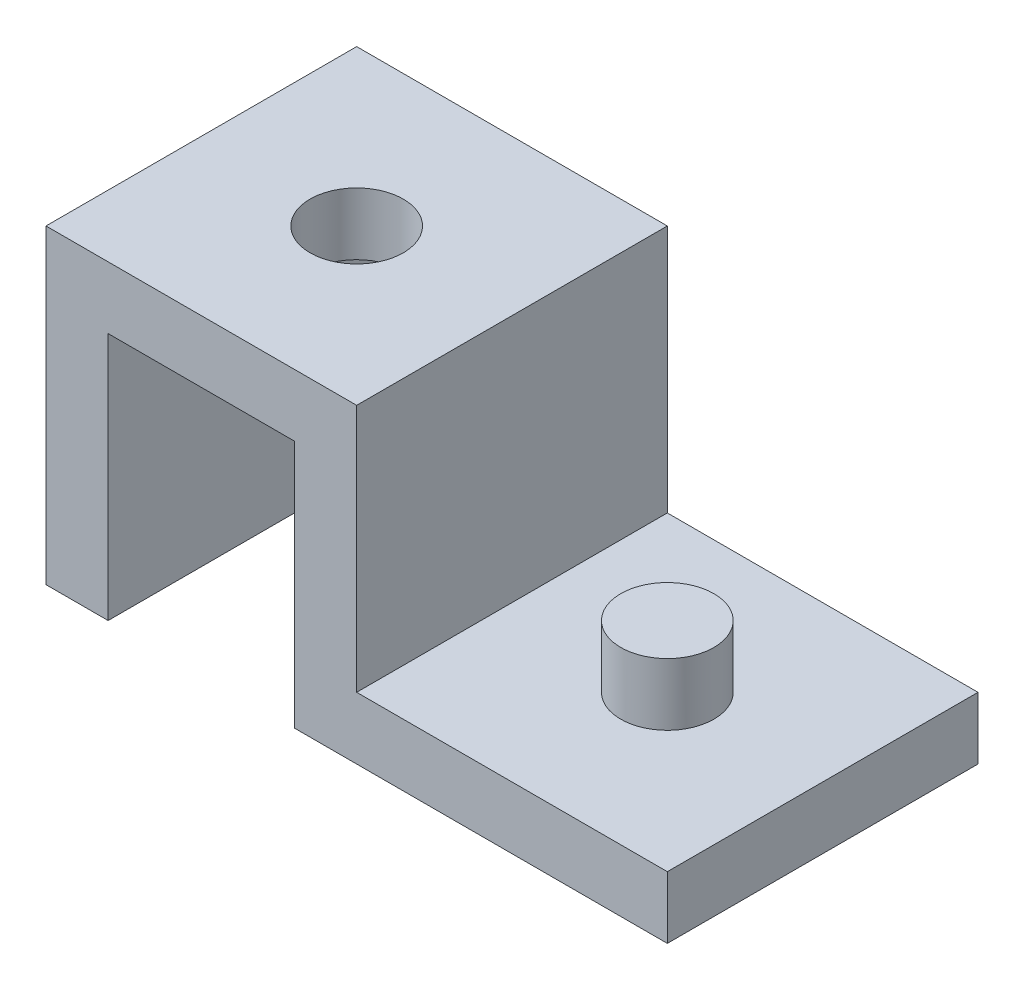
ISO-10303-21;
HEADER;
FILE_DESCRIPTION(('STEP AP214'),'2;1');
FILE_NAME('part.step','',(''),(''),'','','');
FILE_SCHEMA(('AUTOMOTIVE_DESIGN { 1 0 10303 214 1 1 1 1 }'));
ENDSEC;
DATA;
#1=APPLICATION_CONTEXT('core data for automotive mechanical design processes');
#2=APPLICATION_PROTOCOL_DEFINITION('international standard','automotive_design',2000,#1);
#3=PRODUCT_CONTEXT('',#1,'mechanical');
#4=PRODUCT('Part','Part','',(#3));
#5=PRODUCT_RELATED_PRODUCT_CATEGORY('part','',(#4));
#6=PRODUCT_DEFINITION_FORMATION('','',#4);
#7=PRODUCT_DEFINITION_CONTEXT('part definition',#1,'design');
#8=PRODUCT_DEFINITION('design','',#6,#7);
#9=PRODUCT_DEFINITION_SHAPE('','',#8);
#10=(LENGTH_UNIT() NAMED_UNIT(*) SI_UNIT(.MILLI.,.METRE.));
#11=(NAMED_UNIT(*) PLANE_ANGLE_UNIT() SI_UNIT($,.RADIAN.));
#12=(NAMED_UNIT(*) SI_UNIT($,.STERADIAN.) SOLID_ANGLE_UNIT());
#13=UNCERTAINTY_MEASURE_WITH_UNIT(LENGTH_MEASURE(1.E-05),#10,'distance_accuracy_value','');
#14=(GEOMETRIC_REPRESENTATION_CONTEXT(3) GLOBAL_UNCERTAINTY_ASSIGNED_CONTEXT((#13)) GLOBAL_UNIT_ASSIGNED_CONTEXT((#10,
#11,#12)) REPRESENTATION_CONTEXT('',''));
#15=CARTESIAN_POINT('',(0.,0.,0.));
#16=DIRECTION('',(0.,0.,1.));
#17=DIRECTION('',(1.,0.,0.));
#18=AXIS2_PLACEMENT_3D('',#15,#16,#17);
#19=CARTESIAN_POINT('',(0.,0.,-50.));
#20=DIRECTION('',(0.,-1.,0.));
#21=DIRECTION('',(0.,0.,-1.));
#22=AXIS2_PLACEMENT_3D('',#19,#20,#21);
#23=PLANE('',#22);
#24=DIRECTION('',(0.,0.,1.));
#25=VECTOR('',#24,1.);
#26=CARTESIAN_POINT('',(10.,0.,-50.));
#27=LINE('',#26,#25);
#28=CARTESIAN_POINT('',(10.,0.,-50.));
#29=VERTEX_POINT('',#28);
#30=CARTESIAN_POINT('',(10.,0.,0.));
#31=VERTEX_POINT('',#30);
#32=EDGE_CURVE('E110',#29,#31,#27,.T.);
#33=ORIENTED_EDGE('',*,*,#32,.T.);
#34=DIRECTION('',(1.,0.,0.));
#35=VECTOR('',#34,1.);
#36=CARTESIAN_POINT('',(0.,0.,0.));
#37=LINE('',#36,#35);
#38=CARTESIAN_POINT('',(0.,0.,0.));
#39=VERTEX_POINT('',#38);
#40=EDGE_CURVE('E140',#39,#31,#37,.T.);
#41=ORIENTED_EDGE('',*,*,#40,.F.);
#42=DIRECTION('',(0.,0.,1.));
#43=VECTOR('',#42,1.);
#44=CARTESIAN_POINT('',(0.,0.,0.));
#45=LINE('',#44,#43);
#46=CARTESIAN_POINT('',(0.,0.,-50.));
#47=VERTEX_POINT('',#46);
#48=EDGE_CURVE('E133',#47,#39,#45,.T.);
#49=ORIENTED_EDGE('',*,*,#48,.F.);
#50=DIRECTION('',(-1.,0.,0.));
#51=VECTOR('',#50,1.);
#52=CARTESIAN_POINT('',(0.,0.,-50.));
#53=LINE('',#52,#51);
#54=EDGE_CURVE('E126',#29,#47,#53,.T.);
#55=ORIENTED_EDGE('',*,*,#54,.F.);
#56=EDGE_LOOP('',(#33,#41,#49,#55));
#57=FACE_BOUND('',#56,.T.);
#58=ADVANCED_FACE('F31',(#57),#23,.T.);
#59=CARTESIAN_POINT('',(0.,50.,0.));
#60=DIRECTION('',(1.,0.,0.));
#61=DIRECTION('',(0.,0.,-1.));
#62=AXIS2_PLACEMENT_3D('',#59,#60,#61);
#63=PLANE('',#62);
#64=ORIENTED_EDGE('',*,*,#48,.T.);
#65=DIRECTION('',(0.,-1.,0.));
#66=VECTOR('',#65,1.);
#67=CARTESIAN_POINT('',(0.,50.,0.));
#68=LINE('',#67,#66);
#69=CARTESIAN_POINT('',(0.,50.,0.));
#70=VERTEX_POINT('',#69);
#71=EDGE_CURVE('E11',#70,#39,#68,.T.);
#72=ORIENTED_EDGE('',*,*,#71,.F.);
#73=DIRECTION('',(0.,0.,1.));
#74=VECTOR('',#73,1.);
#75=CARTESIAN_POINT('',(0.,50.,0.));
#76=LINE('',#75,#74);
#77=CARTESIAN_POINT('',(0.,50.,-50.));
#78=VERTEX_POINT('',#77);
#79=EDGE_CURVE('E138',#78,#70,#76,.T.);
#80=ORIENTED_EDGE('',*,*,#79,.F.);
#81=DIRECTION('',(0.,-1.,0.));
#82=VECTOR('',#81,1.);
#83=CARTESIAN_POINT('',(0.,50.,-50.));
#84=LINE('',#83,#82);
#85=EDGE_CURVE('E144',#78,#47,#84,.T.);
#86=ORIENTED_EDGE('',*,*,#85,.T.);
#87=EDGE_LOOP('',(#64,#72,#80,#86));
#88=FACE_BOUND('',#87,.T.);
#89=ADVANCED_FACE('F33',(#88),#63,.F.);
#90=CARTESIAN_POINT('',(0.,50.,0.));
#91=DIRECTION('',(0.,0.,-1.));
#92=DIRECTION('',(-1.,0.,0.));
#93=AXIS2_PLACEMENT_3D('',#90,#91,#92);
#94=PLANE('',#93);
#95=ORIENTED_EDGE('',*,*,#40,.T.);
#96=DIRECTION('',(0.,-1.,0.));
#97=VECTOR('',#96,1.);
#98=CARTESIAN_POINT('',(10.,0.,0.));
#99=LINE('',#98,#97);
#100=CARTESIAN_POINT('',(10.,40.,0.));
#101=VERTEX_POINT('',#100);
#102=EDGE_CURVE('E116',#101,#31,#99,.T.);
#103=ORIENTED_EDGE('',*,*,#102,.F.);
#104=DIRECTION('',(-1.,0.,0.));
#105=VECTOR('',#104,1.);
#106=CARTESIAN_POINT('',(10.,40.,0.));
#107=LINE('',#106,#105);
#108=CARTESIAN_POINT('',(40.,40.,0.));
#109=VERTEX_POINT('',#108);
#110=EDGE_CURVE('E129',#109,#101,#107,.T.);
#111=ORIENTED_EDGE('',*,*,#110,.F.);
#112=DIRECTION('',(0.,1.,0.));
#113=VECTOR('',#112,1.);
#114=CARTESIAN_POINT('',(40.,0.,0.));
#115=LINE('',#114,#113);
#116=CARTESIAN_POINT('',(40.,0.,0.));
#117=VERTEX_POINT('',#116);
#118=EDGE_CURVE('E155',#117,#109,#115,.T.);
#119=ORIENTED_EDGE('',*,*,#118,.F.);
#120=CARTESIAN_POINT('',(100.,0.,0.));
#121=VERTEX_POINT('',#120);
#122=EDGE_CURVE('E198',#117,#121,#37,.T.);
#123=ORIENTED_EDGE('',*,*,#122,.T.);
#124=DIRECTION('',(0.,-1.,0.));
#125=VECTOR('',#124,1.);
#126=CARTESIAN_POINT('',(100.,50.,0.));
#127=LINE('',#126,#125);
#128=CARTESIAN_POINT('',(100.,10.,0.));
#129=VERTEX_POINT('',#128);
#130=EDGE_CURVE('E40',#129,#121,#127,.T.);
#131=ORIENTED_EDGE('',*,*,#130,.F.);
#132=DIRECTION('',(1.,0.,0.));
#133=VECTOR('',#132,1.);
#134=CARTESIAN_POINT('',(100.,10.,0.));
#135=LINE('',#134,#133);
#136=CARTESIAN_POINT('',(50.,9.99999999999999,0.));
#137=VERTEX_POINT('',#136);
#138=EDGE_CURVE('E179',#137,#129,#135,.T.);
#139=ORIENTED_EDGE('',*,*,#138,.F.);
#140=DIRECTION('',(0.,-1.,0.));
#141=VECTOR('',#140,1.);
#142=CARTESIAN_POINT('',(50.,50.,0.));
#143=LINE('',#142,#141);
#144=CARTESIAN_POINT('',(50.,50.,0.));
#145=VERTEX_POINT('',#144);
#146=EDGE_CURVE('E173',#145,#137,#143,.T.);
#147=ORIENTED_EDGE('',*,*,#146,.F.);
#148=DIRECTION('',(1.,0.,0.));
#149=VECTOR('',#148,1.);
#150=CARTESIAN_POINT('',(0.,50.,0.));
#151=LINE('',#150,#149);
#152=EDGE_CURVE('E194',#70,#145,#151,.T.);
#153=ORIENTED_EDGE('',*,*,#152,.F.);
#154=ORIENTED_EDGE('',*,*,#71,.T.);
#155=EDGE_LOOP('',(#95,#103,#111,#119,#123,#131,#139,#147,#153,#154));
#156=FACE_BOUND('',#155,.T.);
#157=ADVANCED_FACE('F203',(#156),#94,.F.);
#158=CARTESIAN_POINT('',(100.,50.,0.));
#159=DIRECTION('',(-1.,0.,0.));
#160=DIRECTION('',(0.,0.,1.));
#161=AXIS2_PLACEMENT_3D('',#158,#159,#160);
#162=PLANE('',#161);
#163=DIRECTION('',(0.,-1.,0.));
#164=VECTOR('',#163,1.);
#165=CARTESIAN_POINT('',(100.,50.,-50.));
#166=LINE('',#165,#164);
#167=CARTESIAN_POINT('',(100.,10.,-50.));
#168=VERTEX_POINT('',#167);
#169=CARTESIAN_POINT('',(100.,0.,-50.));
#170=VERTEX_POINT('',#169);
#171=EDGE_CURVE('E146',#168,#170,#166,.T.);
#172=ORIENTED_EDGE('',*,*,#171,.F.);
#173=DIRECTION('',(0.,0.,1.));
#174=VECTOR('',#173,1.);
#175=CARTESIAN_POINT('',(100.,10.,-50.));
#176=LINE('',#175,#174);
#177=EDGE_CURVE('E186',#168,#129,#176,.T.);
#178=ORIENTED_EDGE('',*,*,#177,.T.);
#179=ORIENTED_EDGE('',*,*,#130,.T.);
#180=DIRECTION('',(0.,0.,-1.));
#181=VECTOR('',#180,1.);
#182=CARTESIAN_POINT('',(100.,0.,0.));
#183=LINE('',#182,#181);
#184=EDGE_CURVE('E135',#121,#170,#183,.T.);
#185=ORIENTED_EDGE('',*,*,#184,.T.);
#186=EDGE_LOOP('',(#172,#178,#179,#185));
#187=FACE_BOUND('',#186,.T.);
#188=ADVANCED_FACE('F210',(#187),#162,.F.);
#189=CARTESIAN_POINT('',(0.,50.,-50.));
#190=DIRECTION('',(0.,0.,1.));
#191=DIRECTION('',(1.,0.,0.));
#192=AXIS2_PLACEMENT_3D('',#189,#190,#191);
#193=PLANE('',#192);
#194=DIRECTION('',(-1.,0.,0.));
#195=VECTOR('',#194,1.);
#196=CARTESIAN_POINT('',(10.,40.,-50.));
#197=LINE('',#196,#195);
#198=CARTESIAN_POINT('',(40.,40.,-50.));
#199=VERTEX_POINT('',#198);
#200=CARTESIAN_POINT('',(10.,40.,-50.));
#201=VERTEX_POINT('',#200);
#202=EDGE_CURVE('E121',#199,#201,#197,.T.);
#203=ORIENTED_EDGE('',*,*,#202,.T.);
#204=DIRECTION('',(0.,-1.,0.));
#205=VECTOR('',#204,1.);
#206=CARTESIAN_POINT('',(10.,0.,-50.));
#207=LINE('',#206,#205);
#208=EDGE_CURVE('E113',#201,#29,#207,.T.);
#209=ORIENTED_EDGE('',*,*,#208,.T.);
#210=ORIENTED_EDGE('',*,*,#54,.T.);
#211=ORIENTED_EDGE('',*,*,#85,.F.);
#212=DIRECTION('',(-1.,0.,0.));
#213=VECTOR('',#212,1.);
#214=CARTESIAN_POINT('',(0.,50.,-50.));
#215=LINE('',#214,#213);
#216=CARTESIAN_POINT('',(50.,50.,-50.));
#217=VERTEX_POINT('',#216);
#218=EDGE_CURVE('E147',#217,#78,#215,.T.);
#219=ORIENTED_EDGE('',*,*,#218,.F.);
#220=DIRECTION('',(0.,-1.,0.));
#221=VECTOR('',#220,1.);
#222=CARTESIAN_POINT('',(50.,50.,-50.));
#223=LINE('',#222,#221);
#224=CARTESIAN_POINT('',(50.,9.99999999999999,-50.));
#225=VERTEX_POINT('',#224);
#226=EDGE_CURVE('E56',#217,#225,#223,.T.);
#227=ORIENTED_EDGE('',*,*,#226,.T.);
#228=DIRECTION('',(1.,0.,0.));
#229=VECTOR('',#228,1.);
#230=CARTESIAN_POINT('',(100.,10.,-50.));
#231=LINE('',#230,#229);
#232=EDGE_CURVE('E178',#225,#168,#231,.T.);
#233=ORIENTED_EDGE('',*,*,#232,.T.);
#234=ORIENTED_EDGE('',*,*,#171,.T.);
#235=CARTESIAN_POINT('',(40.,0.,-50.));
#236=VERTEX_POINT('',#235);
#237=EDGE_CURVE('E134',#170,#236,#53,.T.);
#238=ORIENTED_EDGE('',*,*,#237,.T.);
#239=DIRECTION('',(0.,1.,0.));
#240=VECTOR('',#239,1.);
#241=CARTESIAN_POINT('',(40.,0.,-50.));
#242=LINE('',#241,#240);
#243=EDGE_CURVE('E48',#236,#199,#242,.T.);
#244=ORIENTED_EDGE('',*,*,#243,.T.);
#245=EDGE_LOOP('',(#203,#209,#210,#211,#219,#227,#233,#234,#238,#244));
#246=FACE_BOUND('',#245,.T.);
#247=ADVANCED_FACE('F124',(#246),#193,.F.);
#248=CARTESIAN_POINT('',(0.,50.,-50.));
#249=DIRECTION('',(0.,-1.,0.));
#250=DIRECTION('',(0.,0.,-1.));
#251=AXIS2_PLACEMENT_3D('',#248,#249,#250);
#252=PLANE('',#251);
#253=CARTESIAN_POINT('',(25.,50.,-25.));
#254=DIRECTION('',(0.,1.,0.));
#255=DIRECTION('',(0.,0.,1.));
#256=AXIS2_PLACEMENT_3D('',#253,#254,#255);
#257=CIRCLE('',#256,7.5);
#258=CARTESIAN_POINT('',(25.,50.,-17.5));
#259=VERTEX_POINT('',#258);
#260=EDGE_CURVE('E152',#259,#259,#257,.T.);
#261=ORIENTED_EDGE('',*,*,#260,.F.);
#262=EDGE_LOOP('',(#261));
#263=FACE_BOUND('',#262,.T.);
#264=ORIENTED_EDGE('',*,*,#152,.T.);
#265=DIRECTION('',(0.,0.,1.));
#266=VECTOR('',#265,1.);
#267=CARTESIAN_POINT('',(50.,50.,-50.));
#268=LINE('',#267,#266);
#269=EDGE_CURVE('E182',#217,#145,#268,.T.);
#270=ORIENTED_EDGE('',*,*,#269,.F.);
#271=ORIENTED_EDGE('',*,*,#218,.T.);
#272=ORIENTED_EDGE('',*,*,#79,.T.);
#273=EDGE_LOOP('',(#264,#270,#271,#272));
#274=FACE_BOUND('',#273,.T.);
#275=ADVANCED_FACE('F219',(#263,#274),#252,.F.);
#276=DIRECTION('',(0.,0.,1.));
#277=VECTOR('',#276,1.);
#278=CARTESIAN_POINT('',(40.,0.,-50.));
#279=LINE('',#278,#277);
#280=EDGE_CURVE('E120',#236,#117,#279,.T.);
#281=ORIENTED_EDGE('',*,*,#280,.F.);
#282=ORIENTED_EDGE('',*,*,#237,.F.);
#283=ORIENTED_EDGE('',*,*,#184,.F.);
#284=ORIENTED_EDGE('',*,*,#122,.F.);
#285=EDGE_LOOP('',(#281,#282,#283,#284));
#286=FACE_BOUND('',#285,.T.);
#287=ADVANCED_FACE('F212',(#286),#23,.T.);
#288=CARTESIAN_POINT('',(100.,10.,-50.));
#289=DIRECTION('',(0.,-1.,0.));
#290=DIRECTION('',(1.,0.,0.));
#291=AXIS2_PLACEMENT_3D('',#288,#289,#290);
#292=PLANE('',#291);
#293=CARTESIAN_POINT('',(75.,10.,-25.));
#294=DIRECTION('',(0.,-1.,0.));
#295=DIRECTION('',(1.,0.,0.));
#296=AXIS2_PLACEMENT_3D('',#293,#294,#295);
#297=CIRCLE('',#296,7.50000000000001);
#298=CARTESIAN_POINT('',(82.5,10.,-25.));
#299=VERTEX_POINT('',#298);
#300=EDGE_CURVE('E35',#299,#299,#297,.T.);
#301=ORIENTED_EDGE('',*,*,#300,.T.);
#302=EDGE_LOOP('',(#301));
#303=FACE_BOUND('',#302,.T.);
#304=ORIENTED_EDGE('',*,*,#138,.T.);
#305=ORIENTED_EDGE('',*,*,#177,.F.);
#306=ORIENTED_EDGE('',*,*,#232,.F.);
#307=DIRECTION('',(0.,0.,1.));
#308=VECTOR('',#307,1.);
#309=CARTESIAN_POINT('',(50.,9.99999999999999,-50.));
#310=LINE('',#309,#308);
#311=EDGE_CURVE('E189',#225,#137,#310,.T.);
#312=ORIENTED_EDGE('',*,*,#311,.T.);
#313=EDGE_LOOP('',(#304,#305,#306,#312));
#314=FACE_BOUND('',#313,.T.);
#315=ADVANCED_FACE('F216',(#303,#314),#292,.F.);
#316=CARTESIAN_POINT('',(50.,50.,-50.));
#317=DIRECTION('',(-1.,0.,0.));
#318=DIRECTION('',(0.,-1.,0.));
#319=AXIS2_PLACEMENT_3D('',#316,#317,#318);
#320=PLANE('',#319);
#321=ORIENTED_EDGE('',*,*,#146,.T.);
#322=ORIENTED_EDGE('',*,*,#311,.F.);
#323=ORIENTED_EDGE('',*,*,#226,.F.);
#324=ORIENTED_EDGE('',*,*,#269,.T.);
#325=EDGE_LOOP('',(#321,#322,#323,#324));
#326=FACE_BOUND('',#325,.T.);
#327=ADVANCED_FACE('F238',(#326),#320,.F.);
#328=CARTESIAN_POINT('',(10.,0.,-50.));
#329=DIRECTION('',(-1.,0.,0.));
#330=DIRECTION('',(0.,0.,1.));
#331=AXIS2_PLACEMENT_3D('',#328,#329,#330);
#332=PLANE('',#331);
#333=ORIENTED_EDGE('',*,*,#102,.T.);
#334=ORIENTED_EDGE('',*,*,#32,.F.);
#335=ORIENTED_EDGE('',*,*,#208,.F.);
#336=DIRECTION('',(0.,0.,1.));
#337=VECTOR('',#336,1.);
#338=CARTESIAN_POINT('',(10.,40.,-50.));
#339=LINE('',#338,#337);
#340=EDGE_CURVE('E171',#201,#101,#339,.T.);
#341=ORIENTED_EDGE('',*,*,#340,.T.);
#342=EDGE_LOOP('',(#333,#334,#335,#341));
#343=FACE_BOUND('',#342,.T.);
#344=ADVANCED_FACE('F112',(#343),#332,.F.);
#345=CARTESIAN_POINT('',(10.,40.,-50.));
#346=DIRECTION('',(0.,1.,0.));
#347=DIRECTION('',(0.,0.,1.));
#348=AXIS2_PLACEMENT_3D('',#345,#346,#347);
#349=PLANE('',#348);
#350=CARTESIAN_POINT('',(25.,40.,-25.));
#351=DIRECTION('',(0.,1.,0.));
#352=DIRECTION('',(0.,0.,1.));
#353=AXIS2_PLACEMENT_3D('',#350,#351,#352);
#354=CIRCLE('',#353,7.5);
#355=CARTESIAN_POINT('',(25.,40.,-17.5));
#356=VERTEX_POINT('',#355);
#357=EDGE_CURVE('E150',#356,#356,#354,.T.);
#358=ORIENTED_EDGE('',*,*,#357,.T.);
#359=EDGE_LOOP('',(#358));
#360=FACE_BOUND('',#359,.T.);
#361=ORIENTED_EDGE('',*,*,#110,.T.);
#362=ORIENTED_EDGE('',*,*,#340,.F.);
#363=ORIENTED_EDGE('',*,*,#202,.F.);
#364=DIRECTION('',(0.,0.,1.));
#365=VECTOR('',#364,1.);
#366=CARTESIAN_POINT('',(40.,40.,-50.));
#367=LINE('',#366,#365);
#368=EDGE_CURVE('E174',#199,#109,#367,.T.);
#369=ORIENTED_EDGE('',*,*,#368,.T.);
#370=EDGE_LOOP('',(#361,#362,#363,#369));
#371=FACE_BOUND('',#370,.T.);
#372=ADVANCED_FACE('F250',(#360,#371),#349,.F.);
#373=CARTESIAN_POINT('',(40.,0.,-50.));
#374=DIRECTION('',(1.,0.,0.));
#375=DIRECTION('',(0.,0.,-1.));
#376=AXIS2_PLACEMENT_3D('',#373,#374,#375);
#377=PLANE('',#376);
#378=ORIENTED_EDGE('',*,*,#118,.T.);
#379=ORIENTED_EDGE('',*,*,#368,.F.);
#380=ORIENTED_EDGE('',*,*,#243,.F.);
#381=ORIENTED_EDGE('',*,*,#280,.T.);
#382=EDGE_LOOP('',(#378,#379,#380,#381));
#383=FACE_BOUND('',#382,.T.);
#384=ADVANCED_FACE('F251',(#383),#377,.F.);
#385=CARTESIAN_POINT('',(25.,0.,-25.));
#386=DIRECTION('',(0.,1.,0.));
#387=DIRECTION('',(0.,0.,1.));
#388=AXIS2_PLACEMENT_3D('',#385,#386,#387);
#389=CYLINDRICAL_SURFACE('',#388,7.5);
#390=ORIENTED_EDGE('',*,*,#260,.T.);
#391=EDGE_LOOP('',(#390));
#392=FACE_BOUND('',#391,.T.);
#393=ORIENTED_EDGE('',*,*,#357,.F.);
#394=EDGE_LOOP('',(#393));
#395=FACE_BOUND('',#394,.T.);
#396=ADVANCED_FACE('F254',(#392,#395),#389,.F.);
#397=CARTESIAN_POINT('',(75.,20.,-25.));
#398=DIRECTION('',(0.,-1.,0.));
#399=DIRECTION('',(0.,0.,-1.));
#400=AXIS2_PLACEMENT_3D('',#397,#398,#399);
#401=CYLINDRICAL_SURFACE('',#400,7.50000000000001);
#402=CARTESIAN_POINT('',(75.,20.,-25.));
#403=DIRECTION('',(0.,-1.,0.));
#404=DIRECTION('',(0.,0.,-1.));
#405=AXIS2_PLACEMENT_3D('',#402,#403,#404);
#406=CIRCLE('',#405,7.50000000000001);
#407=CARTESIAN_POINT('',(75.,20.,-32.5));
#408=VERTEX_POINT('',#407);
#409=EDGE_CURVE('E162',#408,#408,#406,.T.);
#410=ORIENTED_EDGE('',*,*,#409,.T.);
#411=EDGE_LOOP('',(#410));
#412=FACE_BOUND('',#411,.T.);
#413=ORIENTED_EDGE('',*,*,#300,.F.);
#414=EDGE_LOOP('',(#413));
#415=FACE_BOUND('',#414,.T.);
#416=ADVANCED_FACE('F259',(#412,#415),#401,.T.);
#417=CARTESIAN_POINT('',(75.,20.,-25.));
#418=DIRECTION('',(0.,-1.,0.));
#419=DIRECTION('',(0.,0.,-1.));
#420=AXIS2_PLACEMENT_3D('',#417,#418,#419);
#421=PLANE('',#420);
#422=ORIENTED_EDGE('',*,*,#409,.F.);
#423=EDGE_LOOP('',(#422));
#424=FACE_BOUND('',#423,.T.);
#425=ADVANCED_FACE('F262',(#424),#421,.F.);
#426=CLOSED_SHELL('',(#58,#89,#157,#188,#247,#275,#287,#315,#327,#344,#372,#384,#396,#416,#425));
#427=MANIFOLD_SOLID_BREP('B2',#426);
#428=ADVANCED_BREP_SHAPE_REPRESENTATION('',(#18,#427),#14);
#429=SHAPE_DEFINITION_REPRESENTATION(#9,#428);
ENDSEC;
END-ISO-10303-21;
